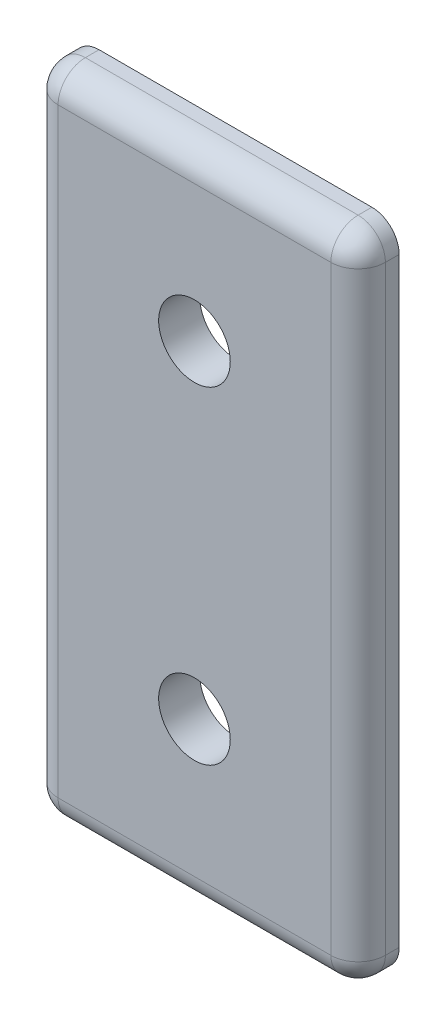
from build123d import *

# Parameters (mm, degrees)
SKETCH1_R      = 4.1671875
EXTRUDE1_DEPTH = 4.7752
FILLET1_R      = 3.175


with BuildPart() as part:
    # Sketch1 → Extrude1 (new body)
    with BuildSketch(Plane.XY):
        with BuildLine():
            Line((-15.875, 38.1), (15.875, 38.1))
            ThreePointArc((15.875, 38.1), (18.12006403, 37.17006403), (19.05, 34.925))
            Line((19.05, 34.925), (19.05, -34.925))
            ThreePointArc((19.05, -34.925), (18.12006403, -37.17006403), (15.875, -38.1))
            Line((15.875, -38.1), (-15.875, -38.1))
            ThreePointArc((-15.875, -38.1), (-18.12006403, -37.17006403), (-19.05, -34.925))
            Line((-19.05, -34.925), (-19.05, 34.925))
            ThreePointArc((-19.05, 34.925), (-18.12006403, 37.17006403), (-15.875, 38.1))
        make_face()
        with Locations((0, 19.05)):
            Circle(SKETCH1_R, mode=Mode.SUBTRACT)
        with Locations((0, -19.05)):
            Circle(SKETCH1_R, mode=Mode.SUBTRACT)
    extrude(amount=EXTRUDE1_DEPTH)

    # Fillet1
    fillet1_edges = [part.edges().sort_by_distance(p)[0] for p in [
        (-18.12006403, -37.17006403, 4.7752),
        (0, -38.1, 4.7752),
        (18.12006403, -37.17006403, 4.7752),
        (19.05, 0, 4.7752),
        (18.12006403, 37.17006403, 4.7752),
        (0, 38.1, 4.7752),
        (-18.12006403, 37.17006403, 4.7752),
        (-19.05, 0, 4.7752),
    ]]
    fillet(fillet1_edges, radius=FILLET1_R)


solid = part.part
